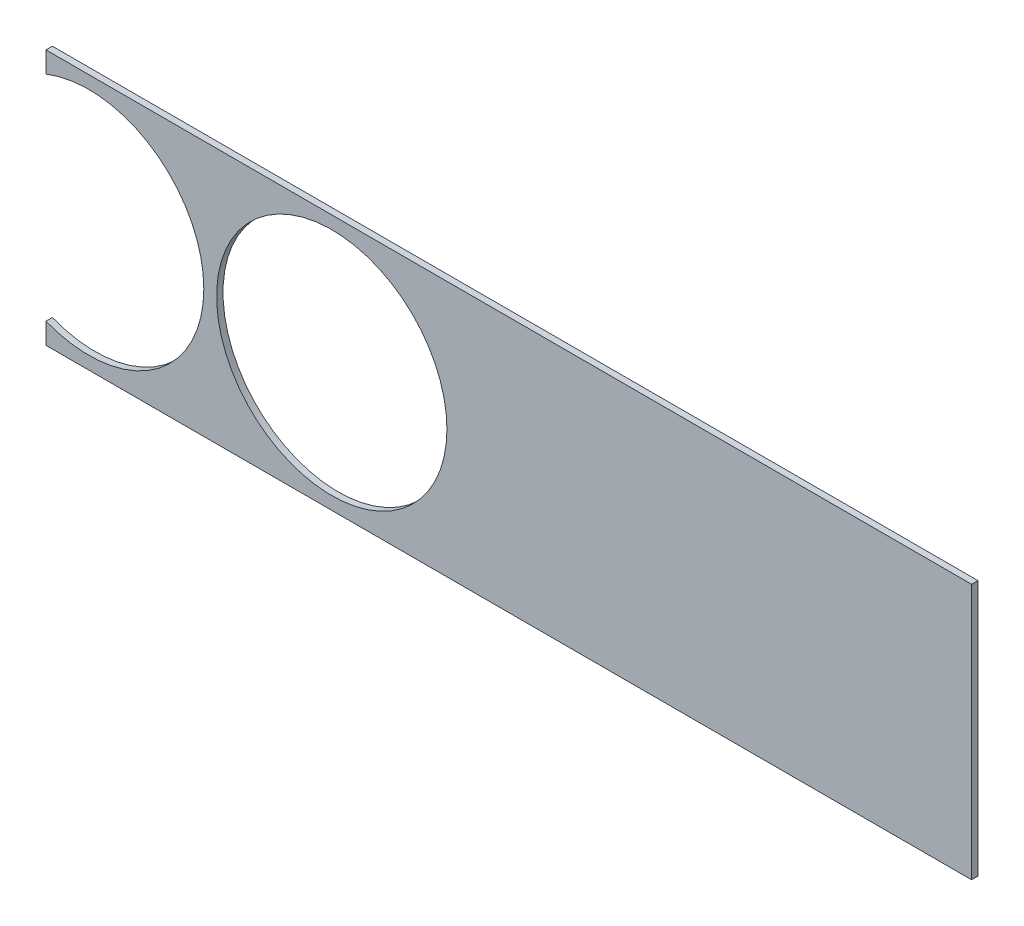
from build123d import *

# Parameters (mm, degrees)
ESQUISSE1_R        = 27
BOSS_EXTRU_1_DEPTH = 1.5


with BuildPart() as part:
    # Esquisse1 → Boss.-Extru.1 (new body)
    with BuildSketch(Plane.XY):
        with BuildLine():
            Line((-67, 30), (150, 30))
            Line((150, 30), (150, -30))
            Line((150, -30), (-67, -30))
            Line((-67, -30), (-67, -25.079872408))
            ThreePointArc((-67, -25.079872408), (-30, 0), (-67, 25.079872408))
            Line((-67, 25.079872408), (-67, 30))
        make_face()
        Circle(ESQUISSE1_R, mode=Mode.SUBTRACT)
    extrude(amount=BOSS_EXTRU_1_DEPTH)


solid = part.part
